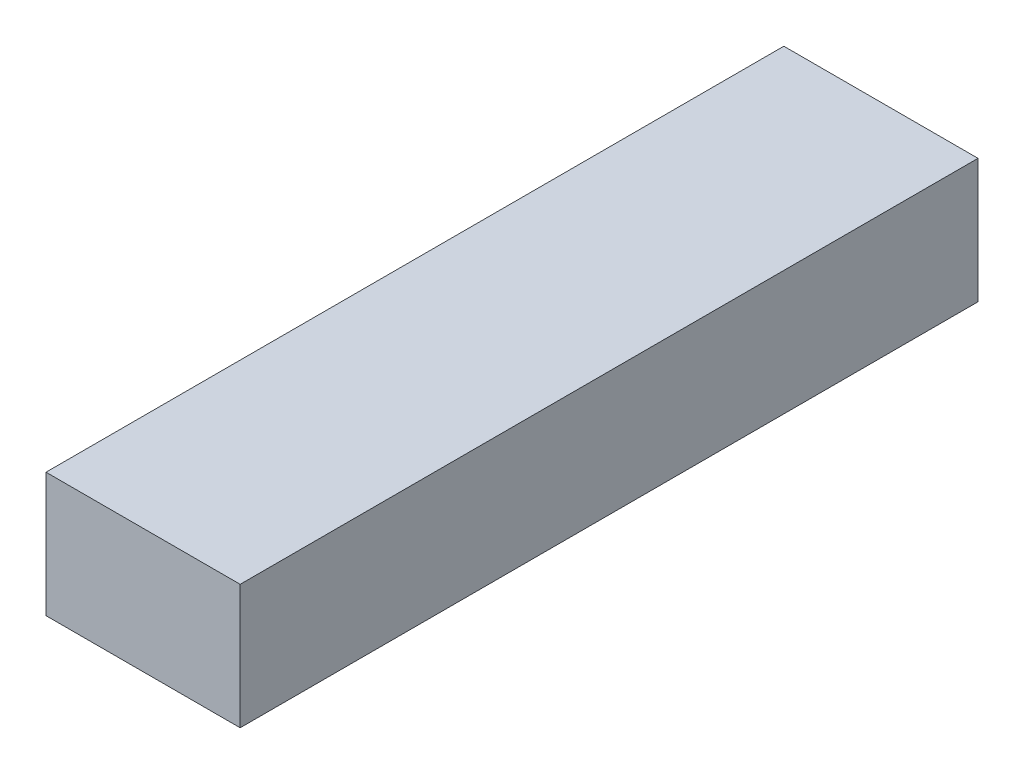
from build123d import *

# Parameters (mm, degrees)
CROQUIS1_W           = 55
CROQUIS1_H           = 35
EXTRUIR1_DEPTH       = 95
CEPILLADO_DEPTH      = 101.436547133
CEPILLADO_DEPTH_BACK = 101.436547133
CROQUIS2_W           = 55
CROQUIS2_H           = 35
CROQUIS2_W_2         = 50
CROQUIS2_H_2         = 32


with BuildPart() as part:
    # Croquis1 → Extruir1 (new, symmetric)
    with BuildSketch(Plane.XY):
        Rectangle(CROQUIS1_W, CROQUIS1_H)
    extrude(amount=EXTRUIR1_DEPTH, both=True)

    # Croquis2 → Cepillado (cut, two sides: drawn at the far end of the back side and taken through both)
    with BuildSketch(Plane.XY.offset(-CEPILLADO_DEPTH_BACK)):
        Rectangle(CROQUIS2_W, CROQUIS2_H)
        Rectangle(CROQUIS2_W_2, CROQUIS2_H_2, mode=Mode.SUBTRACT)
    extrude(amount=CEPILLADO_DEPTH + CEPILLADO_DEPTH_BACK, mode=Mode.SUBTRACT)


solid = part.part
